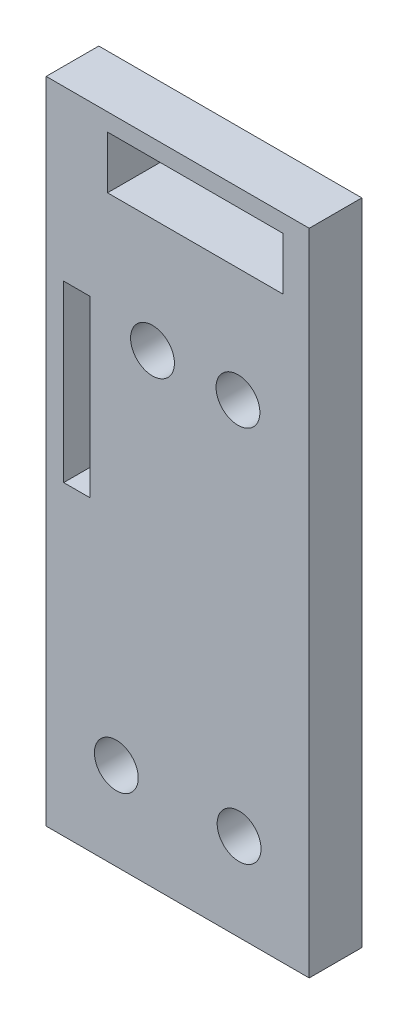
from build123d import *

# Parameters (mm, degrees)
SKETCH1_W           = 30
SKETCH1_H           = 74.052878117
SKETCH1_R           = 2.5
SKETCH1_W_2         = 3
SKETCH1_H_2         = 19.898661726
SKETCH1_W_3         = 20
SKETCH1_H_3         = 6
BOSS_EXTRUDE1_DEPTH = 6


with BuildPart() as part:
    # Sketch1 → Boss-Extrude1 (new body)
    with BuildSketch(Plane.XY):
        with Locations((313.028662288, 29.725019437)):
            Rectangle(SKETCH1_W, SKETCH1_H)
        with Locations((320.028662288, 2.698580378)):
            Circle(SKETCH1_R, mode=Mode.SUBTRACT)
        with Locations(Location((306.028662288, 2.698580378, 0), (0, 0, 180))):
            Circle(SKETCH1_R, mode=Mode.SUBTRACT)
        with Locations((310.153662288, 45.726954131)):
            Circle(SKETCH1_R, mode=Mode.SUBTRACT)
        with Locations(Location((319.903662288, 45.726954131, 0), (0, 0, 180))):
            Circle(SKETCH1_R, mode=Mode.SUBTRACT)
        with Locations((301.528662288, 37.580135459)):
            Rectangle(SKETCH1_W_2, SKETCH1_H_2, mode=Mode.SUBTRACT)
        with Locations((315.028662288, 61.751458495)):
            Rectangle(SKETCH1_W_3, SKETCH1_H_3, mode=Mode.SUBTRACT)
    extrude(amount=BOSS_EXTRUDE1_DEPTH)


solid = part.part
